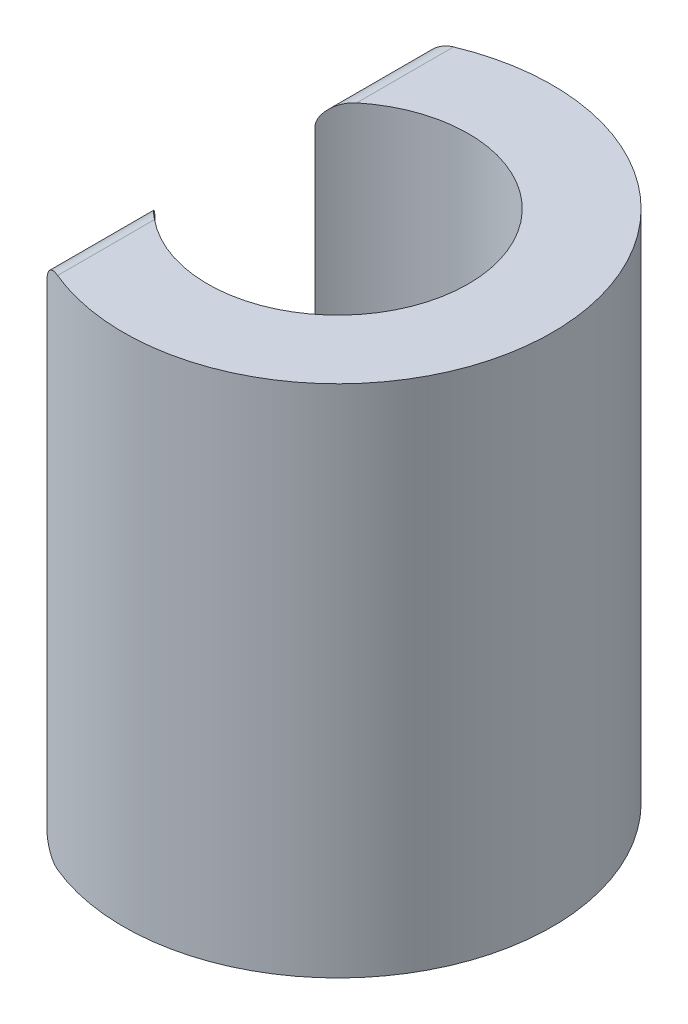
from build123d import *

# Parameters (mm, degrees)
BOSS_EXTRUDE1_DEPTH = 19.05
FILLET1_R           = 0.762


with BuildPart() as part:
    # Sketch1 → Boss-Extrude1 (new body)
    with BuildSketch(Plane(origin=(0, 0, 0), x_dir=(1, 0, 0), z_dir=(0, 1, 0))):
        with BuildLine():
            Line((-3.81, 6.963318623), (-3.81, 2.962123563))
            ThreePointArc((-3.81, 2.962123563), (4.826, 0), (-3.81, -2.962123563))
            Line((-3.81, -2.962123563), (-3.81, -6.963318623))
            ThreePointArc((-3.81, -6.963318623), (7.9375, 0), (-3.81, 6.963318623))
        make_face()
    extrude(amount=BOSS_EXTRUDE1_DEPTH)

    # Fillet1
    fillet1_edges = [part.edges().sort_by_distance(p)[0] for p in [
        (-3.81, 19.05, 4.962721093),
        (-3.81, 0, 4.962721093),
        (-3.81, 0, -4.962721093),
        (-3.81, 19.05, -4.962721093),
    ]]
    fillet(fillet1_edges, radius=FILLET1_R)


solid = part.part
